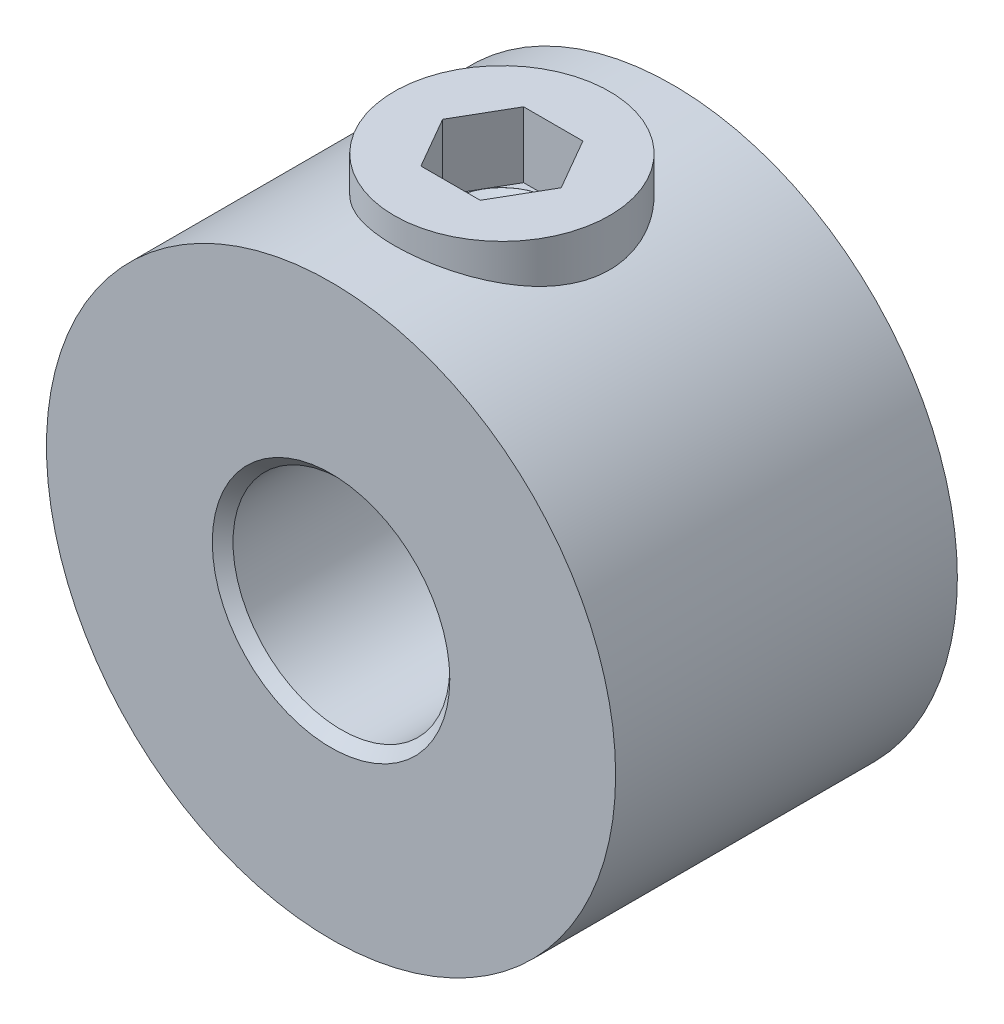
ISO-10303-21;
HEADER;
FILE_DESCRIPTION(('STEP AP214'),'2;1');
FILE_NAME('part.step','',(''),(''),'','','');
FILE_SCHEMA(('AUTOMOTIVE_DESIGN { 1 0 10303 214 1 1 1 1 }'));
ENDSEC;
DATA;
#1=APPLICATION_CONTEXT('core data for automotive mechanical design processes');
#2=APPLICATION_PROTOCOL_DEFINITION('international standard','automotive_design',2000,#1);
#3=PRODUCT_CONTEXT('',#1,'mechanical');
#4=PRODUCT('Part','Part','',(#3));
#5=PRODUCT_RELATED_PRODUCT_CATEGORY('part','',(#4));
#6=PRODUCT_DEFINITION_FORMATION('','',#4);
#7=PRODUCT_DEFINITION_CONTEXT('part definition',#1,'design');
#8=PRODUCT_DEFINITION('design','',#6,#7);
#9=PRODUCT_DEFINITION_SHAPE('','',#8);
#10=(LENGTH_UNIT() NAMED_UNIT(*) SI_UNIT(.MILLI.,.METRE.));
#11=(NAMED_UNIT(*) PLANE_ANGLE_UNIT() SI_UNIT($,.RADIAN.));
#12=(NAMED_UNIT(*) SI_UNIT($,.STERADIAN.) SOLID_ANGLE_UNIT());
#13=UNCERTAINTY_MEASURE_WITH_UNIT(LENGTH_MEASURE(1.E-05),#10,'distance_accuracy_value','');
#14=(GEOMETRIC_REPRESENTATION_CONTEXT(3) GLOBAL_UNCERTAINTY_ASSIGNED_CONTEXT((#13)) GLOBAL_UNIT_ASSIGNED_CONTEXT((#10,
#11,#12)) REPRESENTATION_CONTEXT('',''));
#15=CARTESIAN_POINT('',(0.,0.,0.));
#16=DIRECTION('',(0.,0.,1.));
#17=DIRECTION('',(1.,0.,0.));
#18=AXIS2_PLACEMENT_3D('',#15,#16,#17);
#19=CARTESIAN_POINT('',(0.,2.698,0.));
#20=DIRECTION('',(0.,1.,0.));
#21=DIRECTION('',(0.,0.,1.));
#22=AXIS2_PLACEMENT_3D('',#19,#20,#21);
#23=CYLINDRICAL_SURFACE('',#22,2.08);
#24=CARTESIAN_POINT('',(0.,2.898,0.));
#25=DIRECTION('',(0.,1.,0.));
#26=DIRECTION('',(0.,0.,1.));
#27=AXIS2_PLACEMENT_3D('',#24,#25,#26);
#28=CIRCLE('',#27,2.08);
#29=CARTESIAN_POINT('',(0.,2.898,2.08));
#30=VERTEX_POINT('',#29);
#31=EDGE_CURVE('E46',#30,#30,#28,.T.);
#32=ORIENTED_EDGE('',*,*,#31,.T.);
#33=EDGE_LOOP('',(#32));
#34=FACE_BOUND('',#33,.T.);
#35=CARTESIAN_POINT('',(0.,6.,0.));
#36=DIRECTION('',(0.,1.,0.));
#37=DIRECTION('',(0.,0.,1.));
#38=AXIS2_PLACEMENT_3D('',#35,#36,#37);
#39=CIRCLE('',#38,2.08);
#40=CARTESIAN_POINT('',(0.,6.,2.08));
#41=VERTEX_POINT('',#40);
#42=EDGE_CURVE('E143',#41,#41,#39,.T.);
#43=ORIENTED_EDGE('',*,*,#42,.F.);
#44=EDGE_LOOP('',(#43));
#45=FACE_BOUND('',#44,.T.);
#46=ADVANCED_FACE('F38',(#34,#45),#23,.T.);
#47=CARTESIAN_POINT('',(0.,2.698,0.));
#48=DIRECTION('',(0.,1.,0.));
#49=DIRECTION('',(0.,0.,1.));
#50=AXIS2_PLACEMENT_3D('',#47,#48,#49);
#51=PLANE('',#50);
#52=CARTESIAN_POINT('',(0.,2.698,0.));
#53=DIRECTION('',(0.,1.,0.));
#54=DIRECTION('',(0.,0.,1.));
#55=AXIS2_PLACEMENT_3D('',#52,#53,#54);
#56=CIRCLE('',#55,1.88);
#57=CARTESIAN_POINT('',(0.,2.698,1.88));
#58=VERTEX_POINT('',#57);
#59=EDGE_CURVE('E12',#58,#58,#56,.F.);
#60=ORIENTED_EDGE('',*,*,#59,.T.);
#61=EDGE_LOOP('',(#60));
#62=FACE_BOUND('',#61,.T.);
#63=ADVANCED_FACE('F166',(#62),#51,.F.);
#64=CARTESIAN_POINT('',(0.,6.,0.));
#65=DIRECTION('',(0.,1.,0.));
#66=DIRECTION('',(0.,0.,1.));
#67=AXIS2_PLACEMENT_3D('',#64,#65,#66);
#68=PLANE('',#67);
#69=DIRECTION('',(-0.5,0.,0.866025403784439));
#70=VECTOR('',#69,1.);
#71=CARTESIAN_POINT('',(-0.572839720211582,6.,-0.992187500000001));
#72=LINE('',#71,#70);
#73=CARTESIAN_POINT('',(-0.572839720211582,6.,-0.992187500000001));
#74=VERTEX_POINT('',#73);
#75=CARTESIAN_POINT('',(-1.14567944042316,6.,0.));
#76=VERTEX_POINT('',#75);
#77=EDGE_CURVE('E53',#74,#76,#72,.T.);
#78=ORIENTED_EDGE('',*,*,#77,.F.);
#79=DIRECTION('',(-1.,0.,0.));
#80=VECTOR('',#79,1.);
#81=CARTESIAN_POINT('',(0.572839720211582,6.,-0.992187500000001));
#82=LINE('',#81,#80);
#83=CARTESIAN_POINT('',(0.572839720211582,6.,-0.992187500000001));
#84=VERTEX_POINT('',#83);
#85=EDGE_CURVE('E139',#84,#74,#82,.T.);
#86=ORIENTED_EDGE('',*,*,#85,.F.);
#87=DIRECTION('',(-0.499999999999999,0.,-0.866025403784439));
#88=VECTOR('',#87,1.);
#89=CARTESIAN_POINT('',(1.14567944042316,6.,0.));
#90=LINE('',#89,#88);
#91=CARTESIAN_POINT('',(1.14567944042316,6.,0.));
#92=VERTEX_POINT('',#91);
#93=EDGE_CURVE('E137',#92,#84,#90,.T.);
#94=ORIENTED_EDGE('',*,*,#93,.F.);
#95=DIRECTION('',(0.499999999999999,0.,-0.866025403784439));
#96=VECTOR('',#95,1.);
#97=CARTESIAN_POINT('',(0.572839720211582,6.,0.992187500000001));
#98=LINE('',#97,#96);
#99=CARTESIAN_POINT('',(0.572839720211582,6.,0.992187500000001));
#100=VERTEX_POINT('',#99);
#101=EDGE_CURVE('E103',#100,#92,#98,.T.);
#102=ORIENTED_EDGE('',*,*,#101,.F.);
#103=DIRECTION('',(1.,0.,0.));
#104=VECTOR('',#103,1.);
#105=CARTESIAN_POINT('',(-0.572839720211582,6.,0.992187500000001));
#106=LINE('',#105,#104);
#107=CARTESIAN_POINT('',(-0.572839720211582,6.,0.992187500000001));
#108=VERTEX_POINT('',#107);
#109=EDGE_CURVE('E133',#108,#100,#106,.T.);
#110=ORIENTED_EDGE('',*,*,#109,.F.);
#111=DIRECTION('',(0.499999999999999,0.,0.866025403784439));
#112=VECTOR('',#111,1.);
#113=CARTESIAN_POINT('',(-1.14567944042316,6.,0.));
#114=LINE('',#113,#112);
#115=EDGE_CURVE('E129',#76,#108,#114,.T.);
#116=ORIENTED_EDGE('',*,*,#115,.F.);
#117=EDGE_LOOP('',(#78,#86,#94,#102,#110,#116));
#118=FACE_BOUND('',#117,.T.);
#119=ORIENTED_EDGE('',*,*,#42,.T.);
#120=EDGE_LOOP('',(#119));
#121=FACE_BOUND('',#120,.T.);
#122=ADVANCED_FACE('F170',(#118,#121),#68,.T.);
#123=CARTESIAN_POINT('',(-0.572839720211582,4.73,-0.992187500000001));
#124=DIRECTION('',(-0.866025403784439,0.,-0.5));
#125=DIRECTION('',(-0.5,0.,0.866025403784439));
#126=AXIS2_PLACEMENT_3D('',#123,#124,#125);
#127=PLANE('',#126);
#128=ORIENTED_EDGE('',*,*,#77,.T.);
#129=DIRECTION('',(0.,1.,0.));
#130=VECTOR('',#129,1.);
#131=CARTESIAN_POINT('',(-1.14567944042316,4.73,0.));
#132=LINE('',#131,#130);
#133=CARTESIAN_POINT('',(-1.14567944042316,4.73,0.));
#134=VERTEX_POINT('',#133);
#135=EDGE_CURVE('E84',#134,#76,#132,.T.);
#136=ORIENTED_EDGE('',*,*,#135,.F.);
#137=DIRECTION('',(-0.5,0.,0.866025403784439));
#138=VECTOR('',#137,1.);
#139=CARTESIAN_POINT('',(-0.572839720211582,4.73,-0.992187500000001));
#140=LINE('',#139,#138);
#141=CARTESIAN_POINT('',(-0.572839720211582,4.73,-0.992187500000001));
#142=VERTEX_POINT('',#141);
#143=EDGE_CURVE('E141',#142,#134,#140,.T.);
#144=ORIENTED_EDGE('',*,*,#143,.F.);
#145=DIRECTION('',(0.,1.,0.));
#146=VECTOR('',#145,1.);
#147=CARTESIAN_POINT('',(-0.572839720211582,4.73,-0.992187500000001));
#148=LINE('',#147,#146);
#149=EDGE_CURVE('E61',#142,#74,#148,.T.);
#150=ORIENTED_EDGE('',*,*,#149,.T.);
#151=EDGE_LOOP('',(#128,#136,#144,#150));
#152=FACE_BOUND('',#151,.T.);
#153=ADVANCED_FACE('F175',(#152),#127,.F.);
#154=CARTESIAN_POINT('',(0.572839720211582,4.73,-0.992187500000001));
#155=DIRECTION('',(0.,0.,-1.));
#156=DIRECTION('',(-1.,0.,0.));
#157=AXIS2_PLACEMENT_3D('',#154,#155,#156);
#158=PLANE('',#157);
#159=ORIENTED_EDGE('',*,*,#85,.T.);
#160=ORIENTED_EDGE('',*,*,#149,.F.);
#161=DIRECTION('',(-1.,0.,0.));
#162=VECTOR('',#161,1.);
#163=CARTESIAN_POINT('',(0.572839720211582,4.73,-0.992187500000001));
#164=LINE('',#163,#162);
#165=CARTESIAN_POINT('',(0.572839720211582,4.73,-0.992187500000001));
#166=VERTEX_POINT('',#165);
#167=EDGE_CURVE('E115',#166,#142,#164,.T.);
#168=ORIENTED_EDGE('',*,*,#167,.F.);
#169=DIRECTION('',(0.,1.,0.));
#170=VECTOR('',#169,1.);
#171=CARTESIAN_POINT('',(0.572839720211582,4.73,-0.992187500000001));
#172=LINE('',#171,#170);
#173=EDGE_CURVE('E107',#166,#84,#172,.T.);
#174=ORIENTED_EDGE('',*,*,#173,.T.);
#175=EDGE_LOOP('',(#159,#160,#168,#174));
#176=FACE_BOUND('',#175,.T.);
#177=ADVANCED_FACE('F180',(#176),#158,.F.);
#178=CARTESIAN_POINT('',(1.14567944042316,4.73,0.));
#179=DIRECTION('',(0.866025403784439,0.,-0.499999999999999));
#180=DIRECTION('',(-0.499999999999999,0.,-0.866025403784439));
#181=AXIS2_PLACEMENT_3D('',#178,#179,#180);
#182=PLANE('',#181);
#183=ORIENTED_EDGE('',*,*,#93,.T.);
#184=ORIENTED_EDGE('',*,*,#173,.F.);
#185=DIRECTION('',(-0.499999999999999,0.,-0.866025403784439));
#186=VECTOR('',#185,1.);
#187=CARTESIAN_POINT('',(1.14567944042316,4.73,0.));
#188=LINE('',#187,#186);
#189=CARTESIAN_POINT('',(1.14567944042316,4.73,0.));
#190=VERTEX_POINT('',#189);
#191=EDGE_CURVE('E111',#190,#166,#188,.T.);
#192=ORIENTED_EDGE('',*,*,#191,.F.);
#193=DIRECTION('',(0.,1.,0.));
#194=VECTOR('',#193,1.);
#195=CARTESIAN_POINT('',(1.14567944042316,4.73,0.));
#196=LINE('',#195,#194);
#197=EDGE_CURVE('E96',#190,#92,#196,.T.);
#198=ORIENTED_EDGE('',*,*,#197,.T.);
#199=EDGE_LOOP('',(#183,#184,#192,#198));
#200=FACE_BOUND('',#199,.T.);
#201=ADVANCED_FACE('F112',(#200),#182,.F.);
#202=CARTESIAN_POINT('',(0.572839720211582,4.73,0.992187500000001));
#203=DIRECTION('',(0.866025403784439,0.,0.499999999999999));
#204=DIRECTION('',(0.499999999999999,0.,-0.866025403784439));
#205=AXIS2_PLACEMENT_3D('',#202,#203,#204);
#206=PLANE('',#205);
#207=ORIENTED_EDGE('',*,*,#101,.T.);
#208=ORIENTED_EDGE('',*,*,#197,.F.);
#209=DIRECTION('',(0.499999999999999,0.,-0.866025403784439));
#210=VECTOR('',#209,1.);
#211=CARTESIAN_POINT('',(0.572839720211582,4.73,0.992187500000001));
#212=LINE('',#211,#210);
#213=CARTESIAN_POINT('',(0.572839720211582,4.73,0.992187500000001));
#214=VERTEX_POINT('',#213);
#215=EDGE_CURVE('E100',#214,#190,#212,.T.);
#216=ORIENTED_EDGE('',*,*,#215,.F.);
#217=DIRECTION('',(0.,1.,0.));
#218=VECTOR('',#217,1.);
#219=CARTESIAN_POINT('',(0.572839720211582,4.73,0.992187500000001));
#220=LINE('',#219,#218);
#221=EDGE_CURVE('E108',#214,#100,#220,.T.);
#222=ORIENTED_EDGE('',*,*,#221,.T.);
#223=EDGE_LOOP('',(#207,#208,#216,#222));
#224=FACE_BOUND('',#223,.T.);
#225=ADVANCED_FACE('F98',(#224),#206,.F.);
#226=CARTESIAN_POINT('',(-0.572839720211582,4.73,0.992187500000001));
#227=DIRECTION('',(0.,0.,1.));
#228=DIRECTION('',(1.,0.,0.));
#229=AXIS2_PLACEMENT_3D('',#226,#227,#228);
#230=PLANE('',#229);
#231=ORIENTED_EDGE('',*,*,#109,.T.);
#232=ORIENTED_EDGE('',*,*,#221,.F.);
#233=DIRECTION('',(1.,0.,0.));
#234=VECTOR('',#233,1.);
#235=CARTESIAN_POINT('',(-0.572839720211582,4.73,0.992187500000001));
#236=LINE('',#235,#234);
#237=CARTESIAN_POINT('',(-0.572839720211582,4.73,0.992187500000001));
#238=VERTEX_POINT('',#237);
#239=EDGE_CURVE('E121',#238,#214,#236,.T.);
#240=ORIENTED_EDGE('',*,*,#239,.F.);
#241=DIRECTION('',(0.,1.,0.));
#242=VECTOR('',#241,1.);
#243=CARTESIAN_POINT('',(-0.572839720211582,4.73,0.992187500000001));
#244=LINE('',#243,#242);
#245=EDGE_CURVE('E146',#238,#108,#244,.T.);
#246=ORIENTED_EDGE('',*,*,#245,.T.);
#247=EDGE_LOOP('',(#231,#232,#240,#246));
#248=FACE_BOUND('',#247,.T.);
#249=ADVANCED_FACE('F184',(#248),#230,.F.);
#250=CARTESIAN_POINT('',(-1.14567944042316,4.73,0.));
#251=DIRECTION('',(-0.866025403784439,0.,0.499999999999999));
#252=DIRECTION('',(0.499999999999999,0.,0.866025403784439));
#253=AXIS2_PLACEMENT_3D('',#250,#251,#252);
#254=PLANE('',#253);
#255=ORIENTED_EDGE('',*,*,#115,.T.);
#256=ORIENTED_EDGE('',*,*,#245,.F.);
#257=DIRECTION('',(0.499999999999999,0.,0.866025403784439));
#258=VECTOR('',#257,1.);
#259=CARTESIAN_POINT('',(-1.14567944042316,4.73,0.));
#260=LINE('',#259,#258);
#261=EDGE_CURVE('E123',#134,#238,#260,.T.);
#262=ORIENTED_EDGE('',*,*,#261,.F.);
#263=ORIENTED_EDGE('',*,*,#135,.T.);
#264=EDGE_LOOP('',(#255,#256,#262,#263));
#265=FACE_BOUND('',#264,.T.);
#266=ADVANCED_FACE('F181',(#265),#254,.F.);
#267=CARTESIAN_POINT('',(-1.71851916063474,4.73,0.9921875));
#268=DIRECTION('',(0.,1.,0.));
#269=DIRECTION('',(0.,0.,1.));
#270=AXIS2_PLACEMENT_3D('',#267,#268,#269);
#271=PLANE('',#270);
#272=CARTESIAN_POINT('',(0.,4.73,0.));
#273=DIRECTION('',(0.,1.,0.));
#274=DIRECTION('',(0.,0.,1.));
#275=AXIS2_PLACEMENT_3D('',#272,#273,#274);
#276=CIRCLE('',#275,0.989999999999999);
#277=CARTESIAN_POINT('',(0.,4.73,0.989999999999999));
#278=VERTEX_POINT('',#277);
#279=EDGE_CURVE('E130',#278,#278,#276,.T.);
#280=ORIENTED_EDGE('',*,*,#279,.F.);
#281=EDGE_LOOP('',(#280));
#282=FACE_BOUND('',#281,.T.);
#283=ORIENTED_EDGE('',*,*,#143,.T.);
#284=ORIENTED_EDGE('',*,*,#261,.T.);
#285=ORIENTED_EDGE('',*,*,#239,.T.);
#286=ORIENTED_EDGE('',*,*,#215,.T.);
#287=ORIENTED_EDGE('',*,*,#191,.T.);
#288=ORIENTED_EDGE('',*,*,#167,.T.);
#289=EDGE_LOOP('',(#283,#284,#285,#286,#287,#288));
#290=FACE_BOUND('',#289,.T.);
#291=ADVANCED_FACE('F118',(#282,#290),#271,.T.);
#292=CARTESIAN_POINT('',(0.,4.73,0.));
#293=DIRECTION('',(0.,1.,0.));
#294=DIRECTION('',(0.,0.,1.));
#295=AXIS2_PLACEMENT_3D('',#292,#293,#294);
#296=CYLINDRICAL_SURFACE('',#295,0.989999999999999);
#297=CARTESIAN_POINT('',(0.,4.7295,0.));
#298=DIRECTION('',(0.,1.,0.));
#299=DIRECTION('',(0.,0.,1.));
#300=AXIS2_PLACEMENT_3D('',#297,#298,#299);
#301=CIRCLE('',#300,0.989999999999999);
#302=CARTESIAN_POINT('',(0.,4.7295,0.989999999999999));
#303=VERTEX_POINT('',#302);
#304=EDGE_CURVE('E205',#303,#303,#301,.T.);
#305=ORIENTED_EDGE('',*,*,#304,.F.);
#306=EDGE_LOOP('',(#305));
#307=FACE_BOUND('',#306,.T.);
#308=ORIENTED_EDGE('',*,*,#279,.T.);
#309=EDGE_LOOP('',(#308));
#310=FACE_BOUND('',#309,.T.);
#311=ADVANCED_FACE('F161',(#307,#310),#296,.F.);
#312=CARTESIAN_POINT('',(0.,4.7295,0.));
#313=DIRECTION('',(0.,1.,0.));
#314=DIRECTION('',(0.,0.,1.));
#315=AXIS2_PLACEMENT_3D('',#312,#313,#314);
#316=CONICAL_SURFACE('',#315,0.989999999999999,1.0471975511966);
#317=CARTESIAN_POINT('',(0.,4.15792323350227,0.));
#318=VERTEX_POINT('',#317);
#319=VERTEX_LOOP('',#318);
#320=FACE_BOUND('',#319,.T.);
#321=ORIENTED_EDGE('',*,*,#304,.T.);
#322=EDGE_LOOP('',(#321));
#323=FACE_BOUND('',#322,.T.);
#324=ADVANCED_FACE('F156',(#320,#323),#316,.F.);
#325=CARTESIAN_POINT('',(0.,2.898,0.));
#326=DIRECTION('',(0.,1.,0.));
#327=DIRECTION('',(0.,0.,1.));
#328=AXIS2_PLACEMENT_3D('',#325,#326,#327);
#329=CONICAL_SURFACE('',#328,2.08,0.78539816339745);
#330=CARTESIAN_POINT('',(0.,2.698,1.88));
#331=CARTESIAN_POINT('',(0.,2.70008333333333,1.88208333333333));
#332=CARTESIAN_POINT('',(0.,2.70216666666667,1.88416666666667));
#333=CARTESIAN_POINT('',(0.,2.70633333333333,1.88833333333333));
#334=CARTESIAN_POINT('',(0.,2.70841666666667,1.89041666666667));
#335=CARTESIAN_POINT('',(0.,2.71258333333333,1.89458333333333));
#336=CARTESIAN_POINT('',(0.,2.71466666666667,1.89666666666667));
#337=CARTESIAN_POINT('',(0.,2.71883333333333,1.90083333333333));
#338=CARTESIAN_POINT('',(0.,2.72091666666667,1.90291666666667));
#339=CARTESIAN_POINT('',(0.,2.72508333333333,1.90708333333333));
#340=CARTESIAN_POINT('',(0.,2.72716666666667,1.90916666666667));
#341=CARTESIAN_POINT('',(0.,2.73133333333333,1.91333333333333));
#342=CARTESIAN_POINT('',(0.,2.73341666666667,1.91541666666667));
#343=CARTESIAN_POINT('',(0.,2.73758333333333,1.91958333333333));
#344=CARTESIAN_POINT('',(0.,2.73966666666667,1.92166666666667));
#345=CARTESIAN_POINT('',(0.,2.74383333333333,1.92583333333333));
#346=CARTESIAN_POINT('',(0.,2.74591666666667,1.92791666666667));
#347=CARTESIAN_POINT('',(0.,2.75008333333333,1.93208333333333));
#348=CARTESIAN_POINT('',(0.,2.75216666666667,1.93416666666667));
#349=CARTESIAN_POINT('',(0.,2.75633333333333,1.93833333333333));
#350=CARTESIAN_POINT('',(0.,2.75841666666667,1.94041666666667));
#351=CARTESIAN_POINT('',(0.,2.76258333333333,1.94458333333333));
#352=CARTESIAN_POINT('',(0.,2.76466666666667,1.94666666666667));
#353=CARTESIAN_POINT('',(0.,2.76883333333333,1.95083333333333));
#354=CARTESIAN_POINT('',(0.,2.77091666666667,1.95291666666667));
#355=CARTESIAN_POINT('',(0.,2.77508333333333,1.95708333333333));
#356=CARTESIAN_POINT('',(0.,2.77716666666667,1.95916666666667));
#357=CARTESIAN_POINT('',(0.,2.78133333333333,1.96333333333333));
#358=CARTESIAN_POINT('',(0.,2.78341666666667,1.96541666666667));
#359=CARTESIAN_POINT('',(0.,2.78758333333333,1.96958333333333));
#360=CARTESIAN_POINT('',(0.,2.78966666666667,1.97166666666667));
#361=CARTESIAN_POINT('',(0.,2.79383333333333,1.97583333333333));
#362=CARTESIAN_POINT('',(0.,2.79591666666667,1.97791666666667));
#363=CARTESIAN_POINT('',(0.,2.80008333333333,1.98208333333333));
#364=CARTESIAN_POINT('',(0.,2.80216666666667,1.98416666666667));
#365=CARTESIAN_POINT('',(0.,2.80633333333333,1.98833333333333));
#366=CARTESIAN_POINT('',(0.,2.80841666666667,1.99041666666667));
#367=CARTESIAN_POINT('',(0.,2.81258333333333,1.99458333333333));
#368=CARTESIAN_POINT('',(0.,2.81466666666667,1.99666666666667));
#369=CARTESIAN_POINT('',(0.,2.81883333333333,2.00083333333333));
#370=CARTESIAN_POINT('',(0.,2.82091666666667,2.00291666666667));
#371=CARTESIAN_POINT('',(0.,2.82508333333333,2.00708333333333));
#372=CARTESIAN_POINT('',(0.,2.82716666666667,2.00916666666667));
#373=CARTESIAN_POINT('',(0.,2.83133333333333,2.01333333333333));
#374=CARTESIAN_POINT('',(0.,2.83341666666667,2.01541666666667));
#375=CARTESIAN_POINT('',(0.,2.83758333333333,2.01958333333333));
#376=CARTESIAN_POINT('',(0.,2.83966666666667,2.02166666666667));
#377=CARTESIAN_POINT('',(0.,2.84383333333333,2.02583333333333));
#378=CARTESIAN_POINT('',(0.,2.84591666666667,2.02791666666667));
#379=CARTESIAN_POINT('',(0.,2.85008333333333,2.03208333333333));
#380=CARTESIAN_POINT('',(0.,2.85216666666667,2.03416666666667));
#381=CARTESIAN_POINT('',(0.,2.85633333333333,2.03833333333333));
#382=CARTESIAN_POINT('',(0.,2.85841666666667,2.04041666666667));
#383=CARTESIAN_POINT('',(0.,2.86258333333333,2.04458333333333));
#384=CARTESIAN_POINT('',(0.,2.86466666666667,2.04666666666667));
#385=CARTESIAN_POINT('',(0.,2.86883333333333,2.05083333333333));
#386=CARTESIAN_POINT('',(0.,2.87091666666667,2.05291666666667));
#387=CARTESIAN_POINT('',(0.,2.87508333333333,2.05708333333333));
#388=CARTESIAN_POINT('',(0.,2.87716666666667,2.05916666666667));
#389=CARTESIAN_POINT('',(0.,2.88133333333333,2.06333333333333));
#390=CARTESIAN_POINT('',(0.,2.88341666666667,2.06541666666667));
#391=CARTESIAN_POINT('',(0.,2.88758333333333,2.06958333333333));
#392=CARTESIAN_POINT('',(0.,2.88966666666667,2.07166666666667));
#393=CARTESIAN_POINT('',(0.,2.89383333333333,2.07583333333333));
#394=CARTESIAN_POINT('',(0.,2.89591666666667,2.07791666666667));
#395=CARTESIAN_POINT('',(0.,2.898,2.08));
#396=B_SPLINE_CURVE_WITH_KNOTS('',3,(#330,#331,#332,#333,#334,#335,#336,#337,#338,#339,#340,
#341,#342,#343,#344,#345,#346,#347,#348,#349,#350,#351,#352,#353,#354,#355,#356,#357,#358,#359,
#360,#361,#362,#363,#364,#365,#366,#367,#368,#369,#370,#371,#372,#373,#374,#375,#376,#377,#378,
#379,#380,#381,#382,#383,#384,#385,#386,#387,#388,#389,#390,#391,#392,#393,#394,#395),
.UNSPECIFIED.,.F.,.F.,(4,2,2,2,2,2,2,2,2,2,2,2,2,2,2,2,2,2,2,2,2,2,2,2,2,2,2,2,2,2,2,2,4),(0.,
0.00883883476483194,0.0176776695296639,0.0265165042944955,0.0353553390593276,0.0441941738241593,
0.0530330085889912,0.061871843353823,0.070710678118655,0.0795495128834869,0.0883883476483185,
0.0972271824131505,0.106066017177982,0.114904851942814,0.123743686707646,0.132582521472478,
0.141421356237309,0.150260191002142,0.159099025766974,0.167937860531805,0.176776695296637,
0.185615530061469,0.194454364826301,0.203293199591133,0.212132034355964,0.220970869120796,
0.229809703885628,0.23864853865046,0.247487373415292,0.256326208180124,0.265165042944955,
0.274003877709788,0.282842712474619),.UNSPECIFIED.);
#397=EDGE_CURVE('BSEAM40',#58,#30,#396,.T.);
#398=ORIENTED_EDGE('',*,*,#59,.F.);
#399=ORIENTED_EDGE('',*,*,#31,.F.);
#400=ORIENTED_EDGE('',*,*,#397,.T.);
#401=ORIENTED_EDGE('',*,*,#397,.F.);
#402=EDGE_LOOP('',(#398,#400,#399,#401));
#403=FACE_BOUND('',#402,.T.);
#404=ADVANCED_FACE('F40',(#403),#329,.T.);
#405=CLOSED_SHELL('',(#46,#63,#122,#153,#177,#201,#225,#249,#266,#291,#311,#324,#404));
#406=MANIFOLD_SOLID_BREP('B2',#405);
#407=CARTESIAN_POINT('',(0.,0.,3.302));
#408=DIRECTION('',(0.,0.,1.));
#409=DIRECTION('',(1.,0.,0.));
#410=AXIS2_PLACEMENT_3D('',#407,#408,#409);
#411=PLANE('',#410);
#412=CARTESIAN_POINT('',(0.,0.,3.302));
#413=DIRECTION('',(0.,0.,1.));
#414=DIRECTION('',(1.,0.,0.));
#415=AXIS2_PLACEMENT_3D('',#412,#413,#414);
#416=CIRCLE('',#415,2.295);
#417=CARTESIAN_POINT('',(2.295,0.,3.302));
#418=VERTEX_POINT('',#417);
#419=EDGE_CURVE('E37',#418,#418,#416,.F.);
#420=ORIENTED_EDGE('',*,*,#419,.T.);
#421=EDGE_LOOP('',(#420));
#422=FACE_BOUND('',#421,.T.);
#423=CARTESIAN_POINT('',(0.,0.,3.302));
#424=DIRECTION('',(0.,0.,1.));
#425=DIRECTION('',(1.,0.,0.));
#426=AXIS2_PLACEMENT_3D('',#423,#424,#425);
#427=CIRCLE('',#426,5.5);
#428=CARTESIAN_POINT('',(5.5,0.,3.302));
#429=VERTEX_POINT('',#428);
#430=EDGE_CURVE('E312',#429,#429,#427,.T.);
#431=ORIENTED_EDGE('',*,*,#430,.T.);
#432=EDGE_LOOP('',(#431));
#433=FACE_BOUND('',#432,.T.);
#434=ADVANCED_FACE('F292',(#422,#433),#411,.T.);
#435=CARTESIAN_POINT('',(0.,0.,-3.302));
#436=DIRECTION('',(0.,0.,1.));
#437=DIRECTION('',(1.,0.,0.));
#438=AXIS2_PLACEMENT_3D('',#435,#436,#437);
#439=PLANE('',#438);
#440=CARTESIAN_POINT('',(0.,0.,-3.302));
#441=DIRECTION('',(0.,0.,1.));
#442=DIRECTION('',(1.,0.,0.));
#443=AXIS2_PLACEMENT_3D('',#440,#441,#442);
#444=CIRCLE('',#443,2.295);
#445=CARTESIAN_POINT('',(2.295,0.,-3.302));
#446=VERTEX_POINT('',#445);
#447=EDGE_CURVE('E307',#446,#446,#444,.T.);
#448=ORIENTED_EDGE('',*,*,#447,.T.);
#449=EDGE_LOOP('',(#448));
#450=FACE_BOUND('',#449,.T.);
#451=CARTESIAN_POINT('',(0.,0.,-3.302));
#452=DIRECTION('',(0.,0.,1.));
#453=DIRECTION('',(1.,0.,0.));
#454=AXIS2_PLACEMENT_3D('',#451,#452,#453);
#455=CIRCLE('',#454,5.5);
#456=CARTESIAN_POINT('',(5.5,0.,-3.302));
#457=VERTEX_POINT('',#456);
#458=EDGE_CURVE('E313',#457,#457,#455,.T.);
#459=ORIENTED_EDGE('',*,*,#458,.F.);
#460=EDGE_LOOP('',(#459));
#461=FACE_BOUND('',#460,.T.);
#462=ADVANCED_FACE('F344',(#450,#461),#439,.F.);
#463=CARTESIAN_POINT('',(0.,0.,3.302));
#464=DIRECTION('',(0.,0.,-1.));
#465=DIRECTION('',(-1.,0.,0.));
#466=AXIS2_PLACEMENT_3D('',#463,#464,#465);
#467=CYLINDRICAL_SURFACE('',#466,5.5);
#468=CARTESIAN_POINT('',(0.,5.5,2.08));
#469=CARTESIAN_POINT('',(0.112577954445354,5.50000328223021,2.08000435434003));
#470=CARTESIAN_POINT('',(0.225126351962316,5.49651359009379,2.07083179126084));
#471=CARTESIAN_POINT('',(0.446855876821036,5.4829417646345,2.03453541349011));
#472=CARTESIAN_POINT('',(0.556037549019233,5.47286070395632,2.00741451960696));
#473=CARTESIAN_POINT('',(0.767803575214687,5.44718712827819,1.93632034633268));
#474=CARTESIAN_POINT('',(0.870400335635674,5.4316053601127,1.89237991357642));
#475=CARTESIAN_POINT('',(1.06675779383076,5.39647934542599,1.78906251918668));
#476=CARTESIAN_POINT('',(1.16051607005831,5.37693401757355,1.72968134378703));
#477=CARTESIAN_POINT('',(1.34057495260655,5.33495454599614,1.59449707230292));
#478=CARTESIAN_POINT('',(1.42644449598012,5.31243768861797,1.51814575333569));
#479=CARTESIAN_POINT('',(1.58450896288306,5.26745641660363,1.35235233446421));
#480=CARTESIAN_POINT('',(1.65669959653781,5.24499202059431,1.26290614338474));
#481=CARTESIAN_POINT('',(1.7881216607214,5.20169234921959,1.06922290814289));
#482=CARTESIAN_POINT('',(1.8467401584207,5.18095436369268,0.964546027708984));
#483=CARTESIAN_POINT('',(1.94534807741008,5.1447449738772,0.745912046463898));
#484=CARTESIAN_POINT('',(1.98534508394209,5.12927142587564,0.631958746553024));
#485=CARTESIAN_POINT('',(2.04386626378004,5.10622840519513,0.402971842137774));
#486=CARTESIAN_POINT('',(2.06321409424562,5.09835704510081,0.288180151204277));
#487=CARTESIAN_POINT('',(2.08246278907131,5.09052724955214,0.0567302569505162));
#488=CARTESIAN_POINT('',(2.08237186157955,5.09056547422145,-0.0599271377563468));
#489=CARTESIAN_POINT('',(2.0633747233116,5.09829058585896,-0.284215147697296));
#490=CARTESIAN_POINT('',(2.04561720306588,5.10551051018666,-0.391962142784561));
#491=CARTESIAN_POINT('',(1.99369195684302,5.12600851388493,-0.602814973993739));
#492=CARTESIAN_POINT('',(1.95952171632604,5.13928752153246,-0.705920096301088));
#493=CARTESIAN_POINT('',(1.87511946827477,5.17068470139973,-0.906882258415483));
#494=CARTESIAN_POINT('',(1.82459286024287,5.1888905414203,-1.00460126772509));
#495=CARTESIAN_POINT('',(1.70911766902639,5.22806150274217,-1.19050462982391));
#496=CARTESIAN_POINT('',(1.64416404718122,5.24902758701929,-1.27868563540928));
#497=CARTESIAN_POINT('',(1.49644493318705,5.29310690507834,-1.44935954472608));
#498=CARTESIAN_POINT('',(1.41276459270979,5.31626887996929,-1.53105001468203));
#499=CARTESIAN_POINT('',(1.23262807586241,5.36089823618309,-1.67947916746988));
#500=CARTESIAN_POINT('',(1.13616987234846,5.38236534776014,-1.74621547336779));
#501=CARTESIAN_POINT('',(0.931140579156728,5.42162603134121,-1.86374723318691));
#502=CARTESIAN_POINT('',(0.822400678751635,5.4393554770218,-1.91427115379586));
#503=CARTESIAN_POINT('',(0.597126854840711,5.46866641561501,-1.99604105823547));
#504=CARTESIAN_POINT('',(0.480596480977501,5.48025068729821,-2.02729575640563));
#505=CARTESIAN_POINT('',(0.249799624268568,5.49547534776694,-2.06808741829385));
#506=CARTESIAN_POINT('',(0.135749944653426,5.499510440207,-2.07870466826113));
#507=CARTESIAN_POINT('',(-0.0925598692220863,5.50040476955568,-2.08107112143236));
#508=CARTESIAN_POINT('',(-0.206819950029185,5.49726562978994,-2.07282459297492));
#509=CARTESIAN_POINT('',(-0.427610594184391,5.48442440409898,-2.03851547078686));
#510=CARTESIAN_POINT('',(-0.534268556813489,5.47498452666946,-2.01316425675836));
#511=CARTESIAN_POINT('',(-0.741739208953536,5.45075591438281,-1.9463059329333));
#512=CARTESIAN_POINT('',(-0.84255113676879,5.43596648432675,-1.90479672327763));
#513=CARTESIAN_POINT('',(-1.03880986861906,5.40195257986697,-1.80547162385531));
#514=CARTESIAN_POINT('',(-1.13400992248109,5.38260990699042,-1.74720989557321));
#515=CARTESIAN_POINT('',(-1.31360344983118,5.34162380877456,-1.61653634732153));
#516=CARTESIAN_POINT('',(-1.39799286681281,5.31997952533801,-1.54411924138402));
#517=CARTESIAN_POINT('',(-1.55878147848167,5.27518488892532,-1.38216301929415));
#518=CARTESIAN_POINT('',(-1.63441510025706,5.25202104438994,-1.29186560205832));
#519=CARTESIAN_POINT('',(-1.76961191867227,5.20802675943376,-1.09941021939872));
#520=CARTESIAN_POINT('',(-1.82917353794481,5.18719654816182,-0.997251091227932));
#521=CARTESIAN_POINT('',(-1.93063144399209,5.15030153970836,-0.783048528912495));
#522=CARTESIAN_POINT('',(-1.9724420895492,5.13425995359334,-0.670960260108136));
#523=CARTESIAN_POINT('',(-2.036314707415,5.10926819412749,-0.440556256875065));
#524=CARTESIAN_POINT('',(-2.05838918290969,5.10031353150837,-0.322244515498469));
#525=CARTESIAN_POINT('',(-2.08103553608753,5.09111248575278,-0.0910634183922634));
#526=CARTESIAN_POINT('',(-2.08291576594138,5.09033629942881,0.021657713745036));
#527=CARTESIAN_POINT('',(-2.06848265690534,5.09621812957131,0.245720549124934));
#528=CARTESIAN_POINT('',(-2.05217110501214,5.10287541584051,0.357062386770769));
#529=CARTESIAN_POINT('',(-2.0028426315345,5.12242973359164,0.571633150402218));
#530=CARTESIAN_POINT('',(-1.97036942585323,5.13512311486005,0.675007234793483));
#531=CARTESIAN_POINT('',(-1.89012196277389,5.16519757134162,0.874898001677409));
#532=CARTESIAN_POINT('',(-1.84234380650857,5.18257984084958,0.971412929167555));
#533=CARTESIAN_POINT('',(-1.72990230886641,5.22122071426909,1.16041493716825));
#534=CARTESIAN_POINT('',(-1.66447756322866,5.24263605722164,1.25241658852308));
#535=CARTESIAN_POINT('',(-1.51977038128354,5.28639832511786,1.42455278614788));
#536=CARTESIAN_POINT('',(-1.44048350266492,5.30874554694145,1.50468351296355));
#537=CARTESIAN_POINT('',(-1.26505304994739,5.35334120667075,1.65533387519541));
#538=CARTESIAN_POINT('',(-1.16821884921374,5.37551554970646,1.72507487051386));
#539=CARTESIAN_POINT('',(-0.963424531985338,5.41596704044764,1.84727680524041));
#540=CARTESIAN_POINT('',(-0.855463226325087,5.43424377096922,1.89973589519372));
#541=CARTESIAN_POINT('',(-0.62565593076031,5.46558722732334,1.98766957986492));
#542=CARTESIAN_POINT('',(-0.503384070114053,5.47834418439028,2.02215250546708));
#543=CARTESIAN_POINT('',(-0.254060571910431,5.49554654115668,2.06830928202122));
#544=CARTESIAN_POINT('',(-0.127011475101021,5.49999629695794,2.07999508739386));
#545=CARTESIAN_POINT('',(0.,5.5,2.08));
#546=B_SPLINE_CURVE_WITH_KNOTS('',3,(#468,#469,#470,#471,#472,#473,#474,#475,#476,#477,#478,
#479,#480,#481,#482,#483,#484,#485,#486,#487,#488,#489,#490,#491,#492,#493,#494,#495,#496,#497,
#498,#499,#500,#501,#502,#503,#504,#505,#506,#507,#508,#509,#510,#511,#512,#513,#514,#515,#516,
#517,#518,#519,#520,#521,#522,#523,#524,#525,#526,#527,#528,#529,#530,#531,#532,#533,#534,#535,
#536,#537,#538,#539,#540,#541,#542,#543,#544,#545),.UNSPECIFIED.,.T.,.F.,(4,2,2,2,2,2,2,2,2,2,2,
2,2,2,2,2,2,2,2,2,2,2,2,2,2,2,2,2,2,2,2,2,2,2,2,2,2,2,4),(0.,0.337265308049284,
0.674475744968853,1.01103098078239,1.34767815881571,1.69739999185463,2.04723132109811,
2.41066318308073,2.77394687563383,3.12212588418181,3.47015787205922,3.79694844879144,
4.12378910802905,4.45687876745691,4.79008494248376,5.14609757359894,5.50216675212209,
5.86392112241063,6.22551177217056,6.56760279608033,6.9096164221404,7.23821722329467,
7.56686074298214,7.90522094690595,8.24370774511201,8.60217262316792,8.96067266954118,
9.32088320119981,9.68086537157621,10.0173724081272,10.3538463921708,10.6796965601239,
11.0056298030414,11.3488567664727,11.6921939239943,12.0545566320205,12.4169581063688,
12.7976635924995,13.178169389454),.UNSPECIFIED.);
#547=CARTESIAN_POINT('',(0.,5.5,2.08));
#548=VERTEX_POINT('',#547);
#549=EDGE_CURVE('E325',#548,#548,#546,.T.);
#550=ORIENTED_EDGE('',*,*,#549,.F.);
#551=EDGE_LOOP('',(#550));
#552=FACE_BOUND('',#551,.T.);
#553=ORIENTED_EDGE('',*,*,#430,.F.);
#554=EDGE_LOOP('',(#553));
#555=FACE_BOUND('',#554,.T.);
#556=ORIENTED_EDGE('',*,*,#458,.T.);
#557=EDGE_LOOP('',(#556));
#558=FACE_BOUND('',#557,.T.);
#559=ADVANCED_FACE('F341',(#552,#555,#558),#467,.T.);
#560=CARTESIAN_POINT('',(0.,0.,3.302));
#561=DIRECTION('',(0.,0.,-1.));
#562=DIRECTION('',(-1.,0.,0.));
#563=AXIS2_PLACEMENT_3D('',#560,#561,#562);
#564=CYLINDRICAL_SURFACE('',#563,2.095);
#565=CARTESIAN_POINT('',(0.,0.,-3.102));
#566=DIRECTION('',(0.,0.,1.));
#567=DIRECTION('',(1.,0.,0.));
#568=AXIS2_PLACEMENT_3D('',#565,#566,#567);
#569=CIRCLE('',#568,2.095);
#570=CARTESIAN_POINT('',(2.095,0.,-3.102));
#571=VERTEX_POINT('',#570);
#572=EDGE_CURVE('E299',#571,#571,#569,.F.);
#573=ORIENTED_EDGE('',*,*,#572,.T.);
#574=EDGE_LOOP('',(#573));
#575=FACE_BOUND('',#574,.T.);
#576=CARTESIAN_POINT('',(0.,0.,3.102));
#577=DIRECTION('',(0.,0.,1.));
#578=DIRECTION('',(1.,0.,0.));
#579=AXIS2_PLACEMENT_3D('',#576,#577,#578);
#580=CIRCLE('',#579,2.095);
#581=CARTESIAN_POINT('',(2.095,0.,3.102));
#582=VERTEX_POINT('',#581);
#583=EDGE_CURVE('E303',#582,#582,#580,.T.);
#584=ORIENTED_EDGE('',*,*,#583,.T.);
#585=EDGE_LOOP('',(#584));
#586=FACE_BOUND('',#585,.T.);
#587=CARTESIAN_POINT('',(0.,2.095,2.08));
#588=CARTESIAN_POINT('',(0.0930366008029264,2.09499515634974,2.07999515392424));
#589=CARTESIAN_POINT('',(0.186109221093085,2.08875030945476,2.07370565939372));
#590=CARTESIAN_POINT('',(0.369044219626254,2.06430936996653,2.04908522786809));
#591=CARTESIAN_POINT('',(0.45890368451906,2.04610270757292,2.03074364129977));
#592=CARTESIAN_POINT('',(0.632242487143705,1.99932684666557,1.98360565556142));
#593=CARTESIAN_POINT('',(0.715759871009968,1.97082653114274,1.95487875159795));
#594=CARTESIAN_POINT('',(0.87557798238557,1.90522092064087,1.8887190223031));
#595=CARTESIAN_POINT('',(0.951876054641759,1.86811247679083,1.85128301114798));
#596=CARTESIAN_POINT('',(1.12623641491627,1.77038964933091,1.75263214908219));
#597=CARTESIAN_POINT('',(1.22043025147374,1.70637002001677,1.68795523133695));
#598=CARTESIAN_POINT('',(1.39307197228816,1.5686424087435,1.54858711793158));
#599=CARTESIAN_POINT('',(1.4714780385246,1.49490953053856,1.47387017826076));
#600=CARTESIAN_POINT('',(1.64046297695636,1.31107263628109,1.28712310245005));
#601=CARTESIAN_POINT('',(1.72409927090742,1.19789790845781,1.17180539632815));
#602=CARTESIAN_POINT('',(1.82931149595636,1.02335851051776,0.992379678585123));
#603=CARTESIAN_POINT('',(1.86100819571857,0.964383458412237,0.931497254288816));
#604=CARTESIAN_POINT('',(1.91796812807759,0.845433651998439,0.807737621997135));
#605=CARTESIAN_POINT('',(1.94323452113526,0.78545940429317,0.744861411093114));
#606=CARTESIAN_POINT('',(1.97979096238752,0.6864321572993,0.639346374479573));
#607=CARTESIAN_POINT('',(1.99288076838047,0.64738550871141,0.597306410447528));
#608=CARTESIAN_POINT('',(2.01646338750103,0.569684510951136,0.512089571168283));
#609=CARTESIAN_POINT('',(2.02695516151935,0.53103032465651,0.468912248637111));
#610=CARTESIAN_POINT('',(2.04402694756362,0.460550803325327,0.387093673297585));
#611=CARTESIAN_POINT('',(2.05095120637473,0.428536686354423,0.348681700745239));
#612=CARTESIAN_POINT('',(2.06284913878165,0.366917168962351,0.269579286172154));
#613=CARTESIAN_POINT('',(2.06782610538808,0.337307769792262,0.228892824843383));
#614=CARTESIAN_POINT('',(2.07319287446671,0.30166988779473,0.168960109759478));
#615=CARTESIAN_POINT('',(2.07452520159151,0.292306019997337,0.151845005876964));
#616=CARTESIAN_POINT('',(2.07680397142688,0.275643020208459,0.116606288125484));
#617=CARTESIAN_POINT('',(2.07775124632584,0.268339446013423,0.0984849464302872));
#618=CARTESIAN_POINT('',(2.07901798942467,0.258320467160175,0.0654926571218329));
#619=CARTESIAN_POINT('',(2.07943191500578,0.254935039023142,0.0508373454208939));
#620=CARTESIAN_POINT('',(2.0799448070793,0.250718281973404,0.0211716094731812));
#621=CARTESIAN_POINT('',(2.08004455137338,0.249880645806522,0.00616215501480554));
#622=CARTESIAN_POINT('',(2.07991820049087,0.250928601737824,-0.0237662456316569));
#623=CARTESIAN_POINT('',(2.07969182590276,0.252816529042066,-0.0386851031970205));
#624=CARTESIAN_POINT('',(2.07893899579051,0.258935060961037,-0.0680373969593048));
#625=CARTESIAN_POINT('',(2.07841178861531,0.263171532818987,-0.0824695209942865));
#626=CARTESIAN_POINT('',(2.07621771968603,0.280143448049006,-0.12971890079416));
#627=CARTESIAN_POINT('',(2.0739726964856,0.296636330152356,-0.161087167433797));
#628=CARTESIAN_POINT('',(2.06839357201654,0.333365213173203,-0.221537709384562));
#629=CARTESIAN_POINT('',(2.06504890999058,0.353636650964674,-0.250594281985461));
#630=CARTESIAN_POINT('',(2.05696196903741,0.398115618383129,-0.310328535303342));
#631=CARTESIAN_POINT('',(2.05210912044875,0.422512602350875,-0.340851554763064));
#632=CARTESIAN_POINT('',(2.04123116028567,0.472286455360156,-0.400879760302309));
#633=CARTESIAN_POINT('',(2.03520515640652,0.497664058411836,-0.430384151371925));
#634=CARTESIAN_POINT('',(2.01536200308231,0.57457642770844,-0.517990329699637));
#635=CARTESIAN_POINT('',(1.99979318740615,0.626813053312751,-0.575089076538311));
#636=CARTESIAN_POINT('',(1.96397876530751,0.731351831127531,-0.687492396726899));
#637=CARTESIAN_POINT('',(1.94374255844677,0.78365364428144,-0.742800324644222));
#638=CARTESIAN_POINT('',(1.89847798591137,0.88770547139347,-0.851859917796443));
#639=CARTESIAN_POINT('',(1.87345393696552,0.939455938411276,-0.905612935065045));
#640=CARTESIAN_POINT('',(1.81840948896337,1.04201938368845,-1.01161017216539));
#641=CARTESIAN_POINT('',(1.78838240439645,1.09283100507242,-1.06385226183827));
#642=CARTESIAN_POINT('',(1.72318666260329,1.19299110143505,-1.16650257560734));
#643=CARTESIAN_POINT('',(1.68801629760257,1.24233908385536,-1.21691018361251));
#644=CARTESIAN_POINT('',(1.57454713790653,1.38739948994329,-1.36477942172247));
#645=CARTESIAN_POINT('',(1.48818286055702,1.48033523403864,-1.45909998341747));
#646=CARTESIAN_POINT('',(1.31959749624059,1.62993028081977,-1.6106347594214));
#647=CARTESIAN_POINT('',(1.24274800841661,1.68954428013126,-1.67092713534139));
#648=CARTESIAN_POINT('',(1.07685569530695,1.79980218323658,-1.78233780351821));
#649=CARTESIAN_POINT('',(0.987829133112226,1.85045784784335,-1.83346812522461));
#650=CARTESIAN_POINT('',(0.815285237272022,1.93176788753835,-1.91549612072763));
#651=CARTESIAN_POINT('',(0.733644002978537,1.96438011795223,-1.94837787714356));
#652=CARTESIAN_POINT('',(0.563794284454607,2.01968237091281,-2.00412182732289));
#653=CARTESIAN_POINT('',(0.475590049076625,2.04237874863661,-2.02699043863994));
#654=CARTESIAN_POINT('',(0.294152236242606,2.07631000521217,-2.06117504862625));
#655=CARTESIAN_POINT('',(0.200889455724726,2.08746870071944,-2.07241425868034));
#656=CARTESIAN_POINT('',(0.0130563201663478,2.09706558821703,-2.08208056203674));
#657=CARTESIAN_POINT('',(-0.0815134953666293,2.09550888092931,-2.08051279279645));
#658=CARTESIAN_POINT('',(-0.258370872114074,2.08069471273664,-2.06559097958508));
#659=CARTESIAN_POINT('',(-0.340883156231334,2.06871716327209,-2.0535261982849));
#660=CARTESIAN_POINT('',(-0.502088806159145,2.03560961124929,-2.02016970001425));
#661=CARTESIAN_POINT('',(-0.580781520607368,2.01447805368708,-1.9988764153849));
#662=CARTESIAN_POINT('',(-0.73649370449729,1.96307162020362,-1.9470583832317));
#663=CARTESIAN_POINT('',(-0.813249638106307,1.93240508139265,-1.91613809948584));
#664=CARTESIAN_POINT('',(-0.959930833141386,1.86389983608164,-1.84702958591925));
#665=CARTESIAN_POINT('',(-1.02985304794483,1.82605795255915,-1.80883813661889));
#666=CARTESIAN_POINT('',(-1.19894972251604,1.72223242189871,-1.70397770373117));
#667=CARTESIAN_POINT('',(-1.29309765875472,1.65220774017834,-1.63318871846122));
#668=CARTESIAN_POINT('',(-1.4643876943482,1.50253073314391,-1.48159455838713));
#669=CARTESIAN_POINT('',(-1.5414747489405,1.42284849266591,-1.4007582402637));
#670=CARTESIAN_POINT('',(-1.65794342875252,1.28287579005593,-1.25827719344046));
#671=CARTESIAN_POINT('',(-1.7016084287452,1.22422312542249,-1.19844297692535));
#672=CARTESIAN_POINT('',(-1.78153556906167,1.10468389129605,-1.07604771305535));
#673=CARTESIAN_POINT('',(-1.81779381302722,1.0437961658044,-1.01348525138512));
#674=CARTESIAN_POINT('',(-1.88310386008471,0.920753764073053,-0.886240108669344));
#675=CARTESIAN_POINT('',(-1.91217193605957,0.858602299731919,-0.821562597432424));
#676=CARTESIAN_POINT('',(-1.96345168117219,0.733767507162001,-0.690105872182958));
#677=CARTESIAN_POINT('',(-1.98566758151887,0.671084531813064,-0.623327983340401));
#678=CARTESIAN_POINT('',(-2.01456885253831,0.575962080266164,-0.518958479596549));
#679=CARTESIAN_POINT('',(-2.02365112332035,0.543127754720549,-0.482368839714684));
#680=CARTESIAN_POINT('',(-2.03996316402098,0.478213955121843,-0.407933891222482));
#681=CARTESIAN_POINT('',(-2.0471887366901,0.446136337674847,-0.370085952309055));
#682=CARTESIAN_POINT('',(-2.05865706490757,0.389421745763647,-0.298998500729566));
#683=CARTESIAN_POINT('',(-2.06319812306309,0.364447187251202,-0.266070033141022));
#684=CARTESIAN_POINT('',(-2.07087535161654,0.317855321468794,-0.197650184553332));
#685=CARTESIAN_POINT('',(-2.07401735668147,0.296224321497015,-0.162170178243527));
#686=CARTESIAN_POINT('',(-2.07724168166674,0.272305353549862,-0.108266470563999));
#687=CARTESIAN_POINT('',(-2.0780449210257,0.266042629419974,-0.0917476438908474));
#688=CARTESIAN_POINT('',(-2.07926123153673,0.25636100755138,-0.0579372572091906));
#689=CARTESIAN_POINT('',(-2.07967664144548,0.252925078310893,-0.0406509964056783));
#690=CARTESIAN_POINT('',(-2.08006769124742,0.249695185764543,-0.00546934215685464));
#691=CARTESIAN_POINT('',(-2.08003731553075,0.249951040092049,0.0124311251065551));
#692=CARTESIAN_POINT('',(-2.07952640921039,0.254161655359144,0.0478153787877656));
#693=CARTESIAN_POINT('',(-2.07904408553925,0.25813114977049,0.0652972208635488));
#694=CARTESIAN_POINT('',(-2.0774293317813,0.270859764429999,0.106097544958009));
#695=CARTESIAN_POINT('',(-2.07611508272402,0.280893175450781,0.128985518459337));
#696=CARTESIAN_POINT('',(-2.07288942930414,0.30379613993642,0.173275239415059));
#697=CARTESIAN_POINT('',(-2.07097503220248,0.316679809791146,0.194668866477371));
#698=CARTESIAN_POINT('',(-2.06390901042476,0.360895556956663,0.262541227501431));
#699=CARTESIAN_POINT('',(-2.05770213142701,0.395157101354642,0.306948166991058));
#700=CARTESIAN_POINT('',(-2.04288269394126,0.465833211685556,0.39362584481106));
#701=CARTESIAN_POINT('',(-2.03426322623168,0.502253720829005,0.435890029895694));
#702=CARTESIAN_POINT('',(-2.01459935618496,0.576083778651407,0.519260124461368));
#703=CARTESIAN_POINT('',(-2.00354674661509,0.613496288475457,0.560361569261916));
#704=CARTESIAN_POINT('',(-1.97903342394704,0.688484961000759,0.641576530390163));
#705=CARTESIAN_POINT('',(-1.9655755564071,0.726060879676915,0.681691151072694));
#706=CARTESIAN_POINT('',(-1.92538794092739,0.828731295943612,0.790375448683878));
#707=CARTESIAN_POINT('',(-1.89618138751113,0.89371953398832,0.858152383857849));
#708=CARTESIAN_POINT('',(-1.83006740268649,1.02231020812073,0.991352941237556));
#709=CARTESIAN_POINT('',(-1.79315325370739,1.08591138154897,1.05677445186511));
#710=CARTESIAN_POINT('',(-1.71141240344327,1.21063376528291,1.1845688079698));
#711=CARTESIAN_POINT('',(-1.66660964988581,1.27176181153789,1.24695017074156));
#712=CARTESIAN_POINT('',(-1.56868560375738,1.39074915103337,1.36809564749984));
#713=CARTESIAN_POINT('',(-1.51557151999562,1.44861121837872,1.42686283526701));
#714=CARTESIAN_POINT('',(-1.38902032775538,1.57127410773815,1.55125923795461));
#715=CARTESIAN_POINT('',(-1.31364461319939,1.63512478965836,1.61588613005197));
#716=CARTESIAN_POINT('',(-1.14993792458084,1.75410242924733,1.73618205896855));
#717=CARTESIAN_POINT('',(-1.06162306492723,1.80924006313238,1.79186205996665));
#718=CARTESIAN_POINT('',(-0.889671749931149,1.89871424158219,1.88215845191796));
#719=CARTESIAN_POINT('',(-0.808112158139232,1.93501028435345,1.91876416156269));
#720=CARTESIAN_POINT('',(-0.637615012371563,1.99766985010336,1.98193744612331));
#721=CARTESIAN_POINT('',(-0.54868757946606,2.02404673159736,2.00851852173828));
#722=CARTESIAN_POINT('',(-0.383303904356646,2.06102616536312,2.04577807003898));
#723=CARTESIAN_POINT('',(-0.307778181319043,2.07369698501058,2.05854201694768));
#724=CARTESIAN_POINT('',(-0.154843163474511,2.09068550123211,2.07565457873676));
#725=CARTESIAN_POINT('',(-0.0774340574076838,2.09500403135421,2.08000403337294));
#726=CARTESIAN_POINT('',(0.,2.095,2.08));
#727=B_SPLINE_CURVE_WITH_KNOTS('',3,(#587,#588,#589,#590,#591,#592,#593,#594,#595,#596,#597,
#598,#599,#600,#601,#602,#603,#604,#605,#606,#607,#608,#609,#610,#611,#612,#613,#614,#615,#616,
#617,#618,#619,#620,#621,#622,#623,#624,#625,#626,#627,#628,#629,#630,#631,#632,#633,#634,#635,
#636,#637,#638,#639,#640,#641,#642,#643,#644,#645,#646,#647,#648,#649,#650,#651,#652,#653,#654,
#655,#656,#657,#658,#659,#660,#661,#662,#663,#664,#665,#666,#667,#668,#669,#670,#671,#672,#673,
#674,#675,#676,#677,#678,#679,#680,#681,#682,#683,#684,#685,#686,#687,#688,#689,#690,#691,#692,
#693,#694,#695,#696,#697,#698,#699,#700,#701,#702,#703,#704,#705,#706,#707,#708,#709,#710,#711,
#712,#713,#714,#715,#716,#717,#718,#719,#720,#721,#722,#723,#724,#725,#726),.UNSPECIFIED.,.T.,
.F.,(4,2,2,2,2,2,2,2,2,2,2,2,2,2,2,2,2,2,2,2,2,2,2,2,2,2,2,2,2,2,2,2,2,2,2,2,2,2,2,2,2,2,2,2,2,
2,2,2,2,2,2,2,2,2,2,2,2,2,2,2,2,2,2,2,2,2,2,2,2,4),(0.,0.278770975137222,0.557788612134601,
0.834972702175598,1.11225834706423,1.50300017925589,1.89476375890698,2.43741619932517,
2.70873388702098,2.97991796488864,3.15642070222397,3.3329939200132,3.48443045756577,
3.63560978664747,3.69419445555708,3.75265182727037,3.79761120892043,3.84245919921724,
3.88734563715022,3.93234472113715,4.03801895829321,4.14473926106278,4.26277236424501,
4.38089559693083,4.61751398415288,4.85365994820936,5.08959399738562,5.32584588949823,
5.56217640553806,6.03389973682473,6.37612046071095,6.71788851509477,6.99835382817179,
7.27863912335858,7.56076354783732,7.84277480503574,8.09437400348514,8.34601595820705,
8.60978877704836,8.8736786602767,9.28250726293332,9.69263626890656,9.97573762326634,
10.2589875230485,10.5415903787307,10.8240183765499,10.9739723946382,11.1242624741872,
11.2489910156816,11.3731943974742,11.4260768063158,11.4786382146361,11.5319095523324,
11.5853931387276,11.6600587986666,11.7351028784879,11.9039537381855,12.0732931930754,
12.2432128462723,12.4129327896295,12.7075984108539,13.0025219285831,13.2965651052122,
13.5903546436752,13.9433242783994,14.2958580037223,14.5841922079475,14.8721366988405,
15.1041800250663,15.3362001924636),.UNSPECIFIED.);
#728=CARTESIAN_POINT('',(0.,2.095,2.08));
#729=VERTEX_POINT('',#728);
#730=EDGE_CURVE('E316',#729,#729,#727,.T.);
#731=ORIENTED_EDGE('',*,*,#730,.T.);
#732=EDGE_LOOP('',(#731));
#733=FACE_BOUND('',#732,.T.);
#734=ADVANCED_FACE('F336',(#575,#586,#733),#564,.F.);
#735=CARTESIAN_POINT('',(0.,-5.501,0.));
#736=DIRECTION('',(0.,1.,0.));
#737=DIRECTION('',(0.,0.,1.));
#738=AXIS2_PLACEMENT_3D('',#735,#736,#737);
#739=CYLINDRICAL_SURFACE('',#738,2.08);
#740=ORIENTED_EDGE('',*,*,#730,.F.);
#741=EDGE_LOOP('',(#740));
#742=FACE_BOUND('',#741,.T.);
#743=ORIENTED_EDGE('',*,*,#549,.T.);
#744=EDGE_LOOP('',(#743));
#745=FACE_BOUND('',#744,.T.);
#746=ADVANCED_FACE('F329',(#742,#745),#739,.F.);
#747=CARTESIAN_POINT('',(0.,0.,-3.302));
#748=DIRECTION('',(0.,0.,-1.));
#749=DIRECTION('',(-1.,0.,0.));
#750=AXIS2_PLACEMENT_3D('',#747,#748,#749);
#751=CONICAL_SURFACE('',#750,2.295,0.785398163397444);
#752=ORIENTED_EDGE('',*,*,#572,.F.);
#753=EDGE_LOOP('',(#752));
#754=FACE_BOUND('',#753,.T.);
#755=ORIENTED_EDGE('',*,*,#447,.F.);
#756=EDGE_LOOP('',(#755));
#757=FACE_BOUND('',#756,.T.);
#758=ADVANCED_FACE('F335',(#754,#757),#751,.F.);
#759=CARTESIAN_POINT('',(0.,0.,3.102));
#760=DIRECTION('',(0.,0.,1.));
#761=DIRECTION('',(1.,0.,0.));
#762=AXIS2_PLACEMENT_3D('',#759,#760,#761);
#763=CONICAL_SURFACE('',#762,2.095,0.785398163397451);
#764=CARTESIAN_POINT('',(2.295,0.,3.302));
#765=CARTESIAN_POINT('',(2.29291666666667,0.,3.29991666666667));
#766=CARTESIAN_POINT('',(2.29083333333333,0.,3.29783333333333));
#767=CARTESIAN_POINT('',(2.28666666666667,0.,3.29366666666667));
#768=CARTESIAN_POINT('',(2.28458333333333,0.,3.29158333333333));
#769=CARTESIAN_POINT('',(2.28041666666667,0.,3.28741666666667));
#770=CARTESIAN_POINT('',(2.27833333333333,0.,3.28533333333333));
#771=CARTESIAN_POINT('',(2.27416666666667,0.,3.28116666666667));
#772=CARTESIAN_POINT('',(2.27208333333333,0.,3.27908333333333));
#773=CARTESIAN_POINT('',(2.26791666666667,0.,3.27491666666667));
#774=CARTESIAN_POINT('',(2.26583333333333,0.,3.27283333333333));
#775=CARTESIAN_POINT('',(2.26166666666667,0.,3.26866666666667));
#776=CARTESIAN_POINT('',(2.25958333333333,0.,3.26658333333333));
#777=CARTESIAN_POINT('',(2.25541666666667,0.,3.26241666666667));
#778=CARTESIAN_POINT('',(2.25333333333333,0.,3.26033333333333));
#779=CARTESIAN_POINT('',(2.24916666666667,0.,3.25616666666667));
#780=CARTESIAN_POINT('',(2.24708333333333,0.,3.25408333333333));
#781=CARTESIAN_POINT('',(2.24291666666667,0.,3.24991666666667));
#782=CARTESIAN_POINT('',(2.24083333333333,0.,3.24783333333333));
#783=CARTESIAN_POINT('',(2.23666666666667,0.,3.24366666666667));
#784=CARTESIAN_POINT('',(2.23458333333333,0.,3.24158333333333));
#785=CARTESIAN_POINT('',(2.23041666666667,0.,3.23741666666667));
#786=CARTESIAN_POINT('',(2.22833333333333,0.,3.23533333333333));
#787=CARTESIAN_POINT('',(2.22416666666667,0.,3.23116666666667));
#788=CARTESIAN_POINT('',(2.22208333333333,0.,3.22908333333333));
#789=CARTESIAN_POINT('',(2.21791666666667,0.,3.22491666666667));
#790=CARTESIAN_POINT('',(2.21583333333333,0.,3.22283333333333));
#791=CARTESIAN_POINT('',(2.21166666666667,0.,3.21866666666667));
#792=CARTESIAN_POINT('',(2.20958333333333,0.,3.21658333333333));
#793=CARTESIAN_POINT('',(2.20541666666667,0.,3.21241666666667));
#794=CARTESIAN_POINT('',(2.20333333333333,0.,3.21033333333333));
#795=CARTESIAN_POINT('',(2.19916666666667,0.,3.20616666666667));
#796=CARTESIAN_POINT('',(2.19708333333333,0.,3.20408333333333));
#797=CARTESIAN_POINT('',(2.19291666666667,0.,3.19991666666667));
#798=CARTESIAN_POINT('',(2.19083333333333,0.,3.19783333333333));
#799=CARTESIAN_POINT('',(2.18666666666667,0.,3.19366666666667));
#800=CARTESIAN_POINT('',(2.18458333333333,0.,3.19158333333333));
#801=CARTESIAN_POINT('',(2.18041666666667,0.,3.18741666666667));
#802=CARTESIAN_POINT('',(2.17833333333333,0.,3.18533333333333));
#803=CARTESIAN_POINT('',(2.17416666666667,0.,3.18116666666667));
#804=CARTESIAN_POINT('',(2.17208333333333,0.,3.17908333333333));
#805=CARTESIAN_POINT('',(2.16791666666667,0.,3.17491666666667));
#806=CARTESIAN_POINT('',(2.16583333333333,0.,3.17283333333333));
#807=CARTESIAN_POINT('',(2.16166666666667,0.,3.16866666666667));
#808=CARTESIAN_POINT('',(2.15958333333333,0.,3.16658333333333));
#809=CARTESIAN_POINT('',(2.15541666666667,0.,3.16241666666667));
#810=CARTESIAN_POINT('',(2.15333333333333,0.,3.16033333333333));
#811=CARTESIAN_POINT('',(2.14916666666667,0.,3.15616666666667));
#812=CARTESIAN_POINT('',(2.14708333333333,0.,3.15408333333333));
#813=CARTESIAN_POINT('',(2.14291666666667,0.,3.14991666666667));
#814=CARTESIAN_POINT('',(2.14083333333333,0.,3.14783333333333));
#815=CARTESIAN_POINT('',(2.13666666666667,0.,3.14366666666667));
#816=CARTESIAN_POINT('',(2.13458333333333,0.,3.14158333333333));
#817=CARTESIAN_POINT('',(2.13041666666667,0.,3.13741666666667));
#818=CARTESIAN_POINT('',(2.12833333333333,0.,3.13533333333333));
#819=CARTESIAN_POINT('',(2.12416666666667,0.,3.13116666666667));
#820=CARTESIAN_POINT('',(2.12208333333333,0.,3.12908333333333));
#821=CARTESIAN_POINT('',(2.11791666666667,0.,3.12491666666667));
#822=CARTESIAN_POINT('',(2.11583333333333,0.,3.12283333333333));
#823=CARTESIAN_POINT('',(2.11166666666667,0.,3.11866666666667));
#824=CARTESIAN_POINT('',(2.10958333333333,0.,3.11658333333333));
#825=CARTESIAN_POINT('',(2.10541666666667,0.,3.11241666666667));
#826=CARTESIAN_POINT('',(2.10333333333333,0.,3.11033333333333));
#827=CARTESIAN_POINT('',(2.09916666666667,0.,3.10616666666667));
#828=CARTESIAN_POINT('',(2.09708333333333,0.,3.10408333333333));
#829=CARTESIAN_POINT('',(2.095,0.,3.102));
#830=B_SPLINE_CURVE_WITH_KNOTS('',3,(#764,#765,#766,#767,#768,#769,#770,#771,#772,#773,#774,
#775,#776,#777,#778,#779,#780,#781,#782,#783,#784,#785,#786,#787,#788,#789,#790,#791,#792,#793,
#794,#795,#796,#797,#798,#799,#800,#801,#802,#803,#804,#805,#806,#807,#808,#809,#810,#811,#812,
#813,#814,#815,#816,#817,#818,#819,#820,#821,#822,#823,#824,#825,#826,#827,#828,#829),
.UNSPECIFIED.,.F.,.F.,(4,2,2,2,2,2,2,2,2,2,2,2,2,2,2,2,2,2,2,2,2,2,2,2,2,2,2,2,2,2,2,2,4),(0.,
0.00883883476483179,0.0176776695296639,0.0265165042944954,0.0353553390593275,0.0441941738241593,
0.053033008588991,0.0618718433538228,0.0707106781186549,0.0795495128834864,0.0883883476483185,
0.09722718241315,0.106066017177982,0.114904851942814,0.123743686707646,0.132582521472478,
0.141421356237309,0.150260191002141,0.159099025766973,0.167937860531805,0.176776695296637,
0.185615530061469,0.1944543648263,0.203293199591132,0.212132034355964,0.220970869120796,
0.229809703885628,0.23864853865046,0.247487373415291,0.256326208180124,0.265165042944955,
0.274003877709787,0.282842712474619),.UNSPECIFIED.);
#831=EDGE_CURVE('BSEAM294',#418,#582,#830,.T.);
#832=ORIENTED_EDGE('',*,*,#419,.F.);
#833=ORIENTED_EDGE('',*,*,#583,.F.);
#834=ORIENTED_EDGE('',*,*,#831,.T.);
#835=ORIENTED_EDGE('',*,*,#831,.F.);
#836=EDGE_LOOP('',(#832,#834,#833,#835));
#837=FACE_BOUND('',#836,.T.);
#838=ADVANCED_FACE('F294',(#837),#763,.F.);
#839=CLOSED_SHELL('',(#434,#462,#559,#734,#746,#758,#838));
#840=MANIFOLD_SOLID_BREP('B6',#839);
#841=ADVANCED_BREP_SHAPE_REPRESENTATION('',(#18,#406,#840),#14);
#842=SHAPE_DEFINITION_REPRESENTATION(#9,#841);
ENDSEC;
END-ISO-10303-21;
